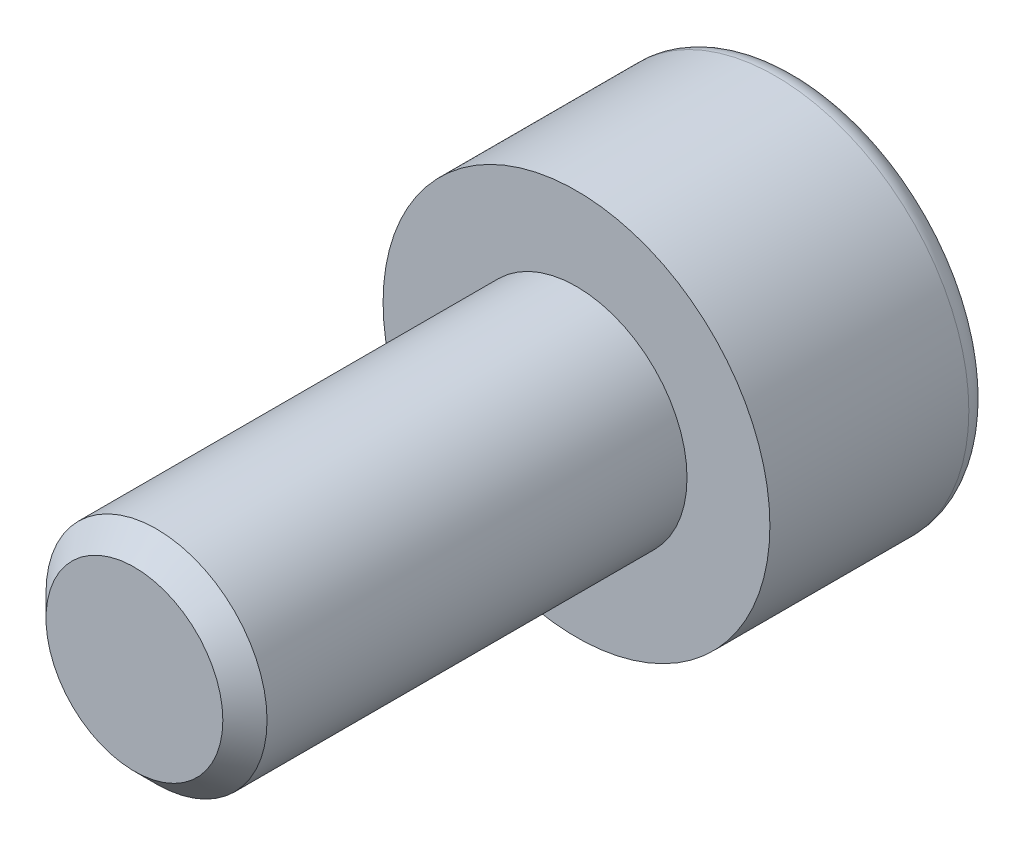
from build123d import *

# Parameters (mm, degrees)
ENLEV_MAT_EXTRU1_DEPTH = 2
ESQUISSE3_W            = 2
ESQUISSE3_H            = 8
CHANFREIN1_SIZE        = 0.4


with BuildPart() as part:
    # Esquisse1 → Base-R_volution (revolve)
    with BuildSketch(Plane(origin=(0, 0, 0), x_dir=(1, 0, 0), z_dir=(0, 1, 0)), mode=Mode.PRIVATE) as base_r_volution_sk:
        with BuildLine():
            Line((0, 0), (3.5, 0))
            Line((3.5, 0), (3.5, 3.6))
            ThreePointArc((3.5, 3.6), (3.382842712, 3.882842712), (3.1, 4))
            Line((3.1, 4), (0, 4))
            Line((0, 4), (0, 0))
        make_face()
    revolve(base_r_volution_sk.sketch.rotate(Axis((0, 0, 0), (0, 0, -1)), 180), axis=Axis((0, 0, 0), (0, 0, -1)))

    # Esquisse2 → enlev-mat-Extru1 (cut)
    with BuildSketch(Plane.XY.offset(-4)):
        Polygon((1.5, -0.866025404), (1.5, 0.866025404), (0, 1.732050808), (-1.5, 0.866025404), (-1.5, -0.866025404), (0, -1.732050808), align=None)
    extrude(amount=ENLEV_MAT_EXTRU1_DEPTH, mode=Mode.SUBTRACT)

    # Esquisse3 → Boss.-R_vol.1 (revolve)
    with BuildSketch(Plane(origin=(0, 0, 0), x_dir=(1, 0, 0), z_dir=(0, 1, 0))):
        with Locations((1, -4)):
            Rectangle(ESQUISSE3_W, ESQUISSE3_H)
    revolve(axis=Axis((0, 0, 0), (0, 0, 1)))

    # Chanfrein1
    chanfrein1_edges = [part.edges().sort_by_distance(p)[0] for p in [
        (-2, 0, 8),
    ]]
    chamfer(chanfrein1_edges, length=CHANFREIN1_SIZE)


solid = part.part
